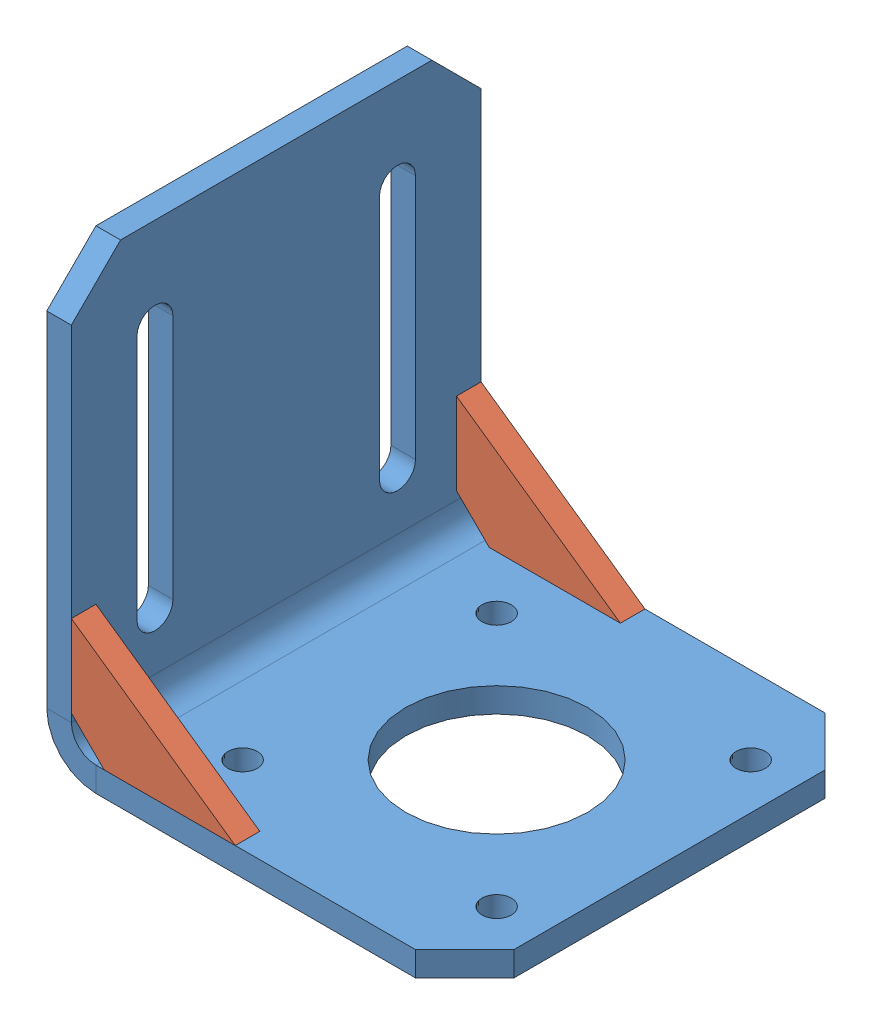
SolidWorks assembly Base stepper.SLDASM, configuration Predeterminado (file format 13000). Lengths in mm.
Overall size (51 54 50).
3 component instances, 2 part files, 6 mates.
Components (placement in the parent):
- Base stepper engine-1: Base stepper engine.SLDPRT [Predeterminado] at origin size (51 54 50)
- flamula-1: flamula.SLDPRT [Predeterminado] at (3 3 50) x (0 1 0) z (0 0 -1) size (14 20 3)
- flamula-2: flamula.SLDPRT [Predeterminado] at (3 3 3) x (0 1 0) z (0 0 -1) size (14 20 3)
Mates (geometry in assembly coordinates):
- Coincident1: coincident aligned: plane of Base stepper engine-1 through (6 6 50) normal (0 0 1); plane of flamula-1 through (3 3 50) normal (0 0 1)
- Coincident2: coincident anti-aligned: plane of Base stepper engine-1 through (3 54 50) normal (1 0 0); plane of flamula-1 through (3 7 47) normal (-1 0 0)
- Coincident3: coincident anti-aligned: plane of Base stepper engine-1 through (0 3 50) normal (0 1 0); plane of flamula-1 through (23 3 47) normal (0 -1 0)
- Coincident4: coincident aligned: plane of Base stepper engine-1 through (3 6 0) normal (0 0 -1); plane of flamula-2 through (3 3 0) normal (0 0 -1)
- Coincident5: coincident anti-aligned: plane of Base stepper engine-1 through (3 54 50) normal (1 0 0); plane of flamula-2 through (3 7 0) normal (-1 0 0)
- Coincident6: coincident anti-aligned: plane of Base stepper engine-1 through (0 3 50) normal (0 1 0); plane of flamula-2 through (23 3 0) normal (0 -1 0)
